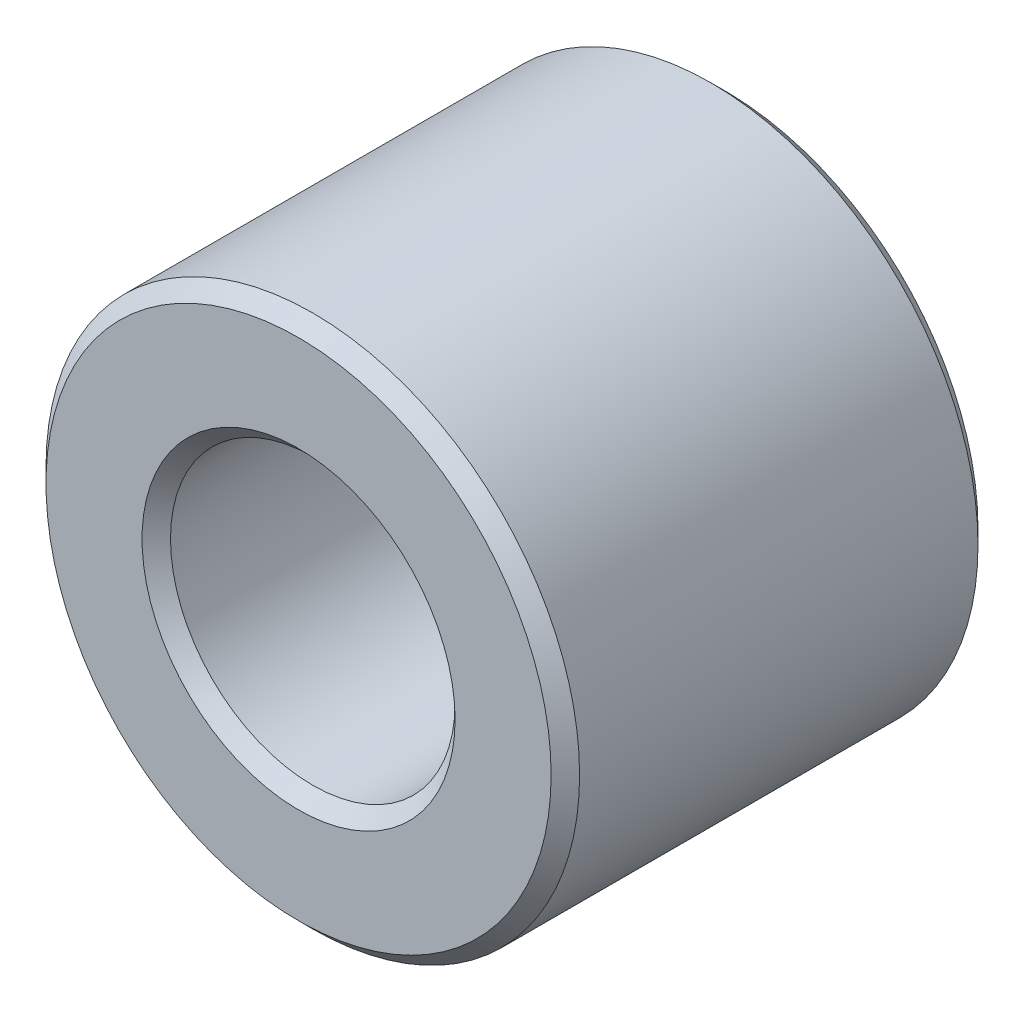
from build123d import *

# Parameters (mm, degrees)
SKETCH1_R           = 30
SKETCH1_R_2         = 16
BOSS_EXTRUDE1_DEPTH = 24
CHAMFER1_SIZE       = 1.6


with BuildPart() as part:
    # Sketch1 → Boss-Extrude1 (new, symmetric)
    with BuildSketch(Plane.XY):
        Circle(SKETCH1_R)
        Circle(SKETCH1_R_2, mode=Mode.SUBTRACT)
    extrude(amount=BOSS_EXTRUDE1_DEPTH, both=True)

    # Chamfer1
    chamfer1_edges = [part.edges().sort_by_distance(p)[0] for p in [
        (-30, 0, -24),
        (-30, 0, 24),
        (-16, 0, -24),
        (-16, 0, 24),
    ]]
    chamfer(chamfer1_edges, length=CHAMFER1_SIZE)


solid = part.part
